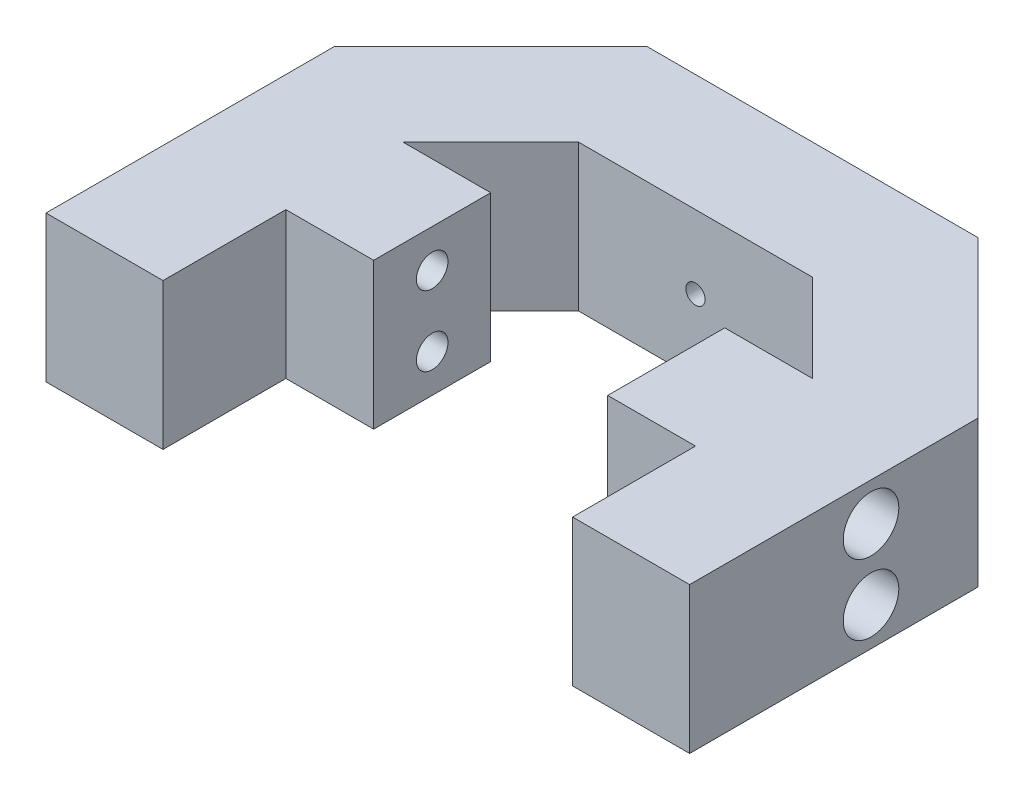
from build123d import *

# Parameters (mm, degrees)
EXTRUDE_1_DEPTH          = 25
SKETCH_2_W               = 15
SKETCH_2_H               = 20
EXTRUDE_2_DEPTH          = 25
SKETCH_3_R               = 1.65
CUT_EXTRUDE_1_DEPTH      = 68
SKETCH_4_R               = 4
CUT_EXTRUDE_2_DEPTH      = 8
CUT_EXTRUDE_3_DEPTH      = 89.600225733
CUT_EXTRUDE_3_DEPTH_BACK = 89.600225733
SKETCH_6_R               = 2.7
SKETCH_7_R               = 4.75
CUT_EXTRUDE_4_DEPTH      = 9
CUT_EXTRUDE_START        = -9
SKETCH_8_R               = 4.75
CUT_EXTRUDE_5_DEPTH      = 9
SKETCH_9_W               = 20
SKETCH_9_H               = 25
EXTRUDE_3_DEPTH          = 16


with BuildPart() as part:
    # Sketch 1 → Extrude 1 (new body)
    with BuildSketch(Plane(origin=(0, 0, 0), x_dir=(1, 0, 0), z_dir=(0, 1, 0))):
        Polygon((-28.284271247, 20), (28.284271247, 20), (55, -6.715728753), (55, -40), (35, -40), (35, -15), (20, 0), (-20, 0), (-35, -15), (-35, -40), (-55, -40), (-55, -6.715728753), align=None)
    extrude(amount=EXTRUDE_1_DEPTH)

    # Sketch 2 → Extrude 2 (add)
    with BuildSketch(Plane(origin=(0, 25, 0), x_dir=(1, 0, 0), z_dir=(0, 1, 0))):
        with Locations((27.5, -25)):
            Rectangle(SKETCH_2_W, SKETCH_2_H)
        with Locations((-27.5, -25)):
            Rectangle(SKETCH_2_W, SKETCH_2_H)
    extrude(amount=-EXTRUDE_2_DEPTH)

    # Sketch 3 → Cut-Extrude 1 (cut)
    with BuildSketch(Plane(origin=(0, 0, -20), x_dir=(-1, 0, 0), z_dir=(0, 0, -1))):
        with Locations((0, 12.5)):
            Circle(SKETCH_3_R)
    extrude(amount=-CUT_EXTRUDE_1_DEPTH, mode=Mode.SUBTRACT)

    # Sketch 4 → Cut-Extrude 2 (cut)
    with BuildSketch(Plane(origin=(0, 0, -20), x_dir=(-1, 0, 0), z_dir=(0, 0, -1))):
        with Locations((0, 12.5)):
            Circle(SKETCH_4_R)
    extrude(amount=-CUT_EXTRUDE_2_DEPTH, mode=Mode.SUBTRACT)

    # Sketch 6 → Cut-Extrude 3 (cut, two sides: drawn at the far end of the back side and taken through both)
    with BuildSketch(Plane.ZY.offset(-20).offset(-CUT_EXTRUDE_3_DEPTH_BACK)):
        with Locations((25, 18.5)):
            Circle(SKETCH_6_R)
        with Locations((25, 6.5)):
            Circle(SKETCH_6_R)
    extrude(amount=CUT_EXTRUDE_3_DEPTH + CUT_EXTRUDE_3_DEPTH_BACK, mode=Mode.SUBTRACT)

    # Sketch 7 → Cut-Extrude 4 (cut)
    with BuildSketch(Plane(origin=(55, 0, 0), x_dir=(0, 0, -1), z_dir=(1, 0, 0))):
        with Locations((-25, 18.5)):
            Circle(SKETCH_7_R)
        with Locations((-25, 6.5)):
            Circle(SKETCH_7_R)
    extrude(amount=-CUT_EXTRUDE_4_DEPTH, mode=Mode.SUBTRACT)

    # Sketch 8 → Cut-Extrude 5 (cut)
    with BuildSketch(Plane.ZY.offset(55).offset(CUT_EXTRUDE_START)):
        with Locations(Location((25, 18.5, 0), (0, 0, 180))):
            Circle(SKETCH_8_R)
        with Locations(Location((25, 6.5, 0), (0, 0, 180))):
            Circle(SKETCH_8_R)
    extrude(amount=CUT_EXTRUDE_5_DEPTH, mode=Mode.SUBTRACT)

    # Sketch 9 → Extrude 3 (add)
    with BuildSketch(Plane.XY.offset(40)):
        with Locations((-45, 12.5)):
            Rectangle(SKETCH_9_W, SKETCH_9_H)
        with Locations((45, 12.5)):
            Rectangle(SKETCH_9_W, SKETCH_9_H)
    extrude(amount=EXTRUDE_3_DEPTH)


solid = part.part
